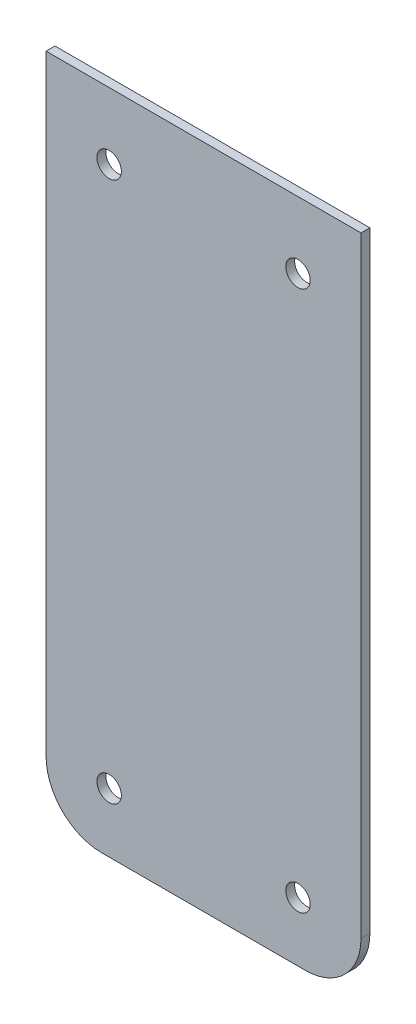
ISO-10303-21;
HEADER;
FILE_DESCRIPTION(('STEP AP214'),'2;1');
FILE_NAME('part.step','',(''),(''),'','','');
FILE_SCHEMA(('AUTOMOTIVE_DESIGN { 1 0 10303 214 1 1 1 1 }'));
ENDSEC;
DATA;
#1=APPLICATION_CONTEXT('core data for automotive mechanical design processes');
#2=APPLICATION_PROTOCOL_DEFINITION('international standard','automotive_design',2000,#1);
#3=PRODUCT_CONTEXT('',#1,'mechanical');
#4=PRODUCT('Part','Part','',(#3));
#5=PRODUCT_RELATED_PRODUCT_CATEGORY('part','',(#4));
#6=PRODUCT_DEFINITION_FORMATION('','',#4);
#7=PRODUCT_DEFINITION_CONTEXT('part definition',#1,'design');
#8=PRODUCT_DEFINITION('design','',#6,#7);
#9=PRODUCT_DEFINITION_SHAPE('','',#8);
#10=(LENGTH_UNIT() NAMED_UNIT(*) SI_UNIT(.MILLI.,.METRE.));
#11=(NAMED_UNIT(*) PLANE_ANGLE_UNIT() SI_UNIT($,.RADIAN.));
#12=(NAMED_UNIT(*) SI_UNIT($,.STERADIAN.) SOLID_ANGLE_UNIT());
#13=UNCERTAINTY_MEASURE_WITH_UNIT(LENGTH_MEASURE(1.E-05),#10,'distance_accuracy_value','');
#14=(GEOMETRIC_REPRESENTATION_CONTEXT(3) GLOBAL_UNCERTAINTY_ASSIGNED_CONTEXT((#13)) GLOBAL_UNIT_ASSIGNED_CONTEXT((#10,
#11,#12)) REPRESENTATION_CONTEXT('',''));
#15=CARTESIAN_POINT('',(0.,0.,0.));
#16=DIRECTION('',(0.,0.,1.));
#17=DIRECTION('',(1.,0.,0.));
#18=AXIS2_PLACEMENT_3D('',#15,#16,#17);
#19=CARTESIAN_POINT('',(28.35,60.,1.6));
#20=DIRECTION('',(-1.,0.,0.));
#21=DIRECTION('',(0.,-1.,0.));
#22=AXIS2_PLACEMENT_3D('',#19,#20,#21);
#23=PLANE('',#22);
#24=DIRECTION('',(0.,1.,0.));
#25=VECTOR('',#24,1.);
#26=CARTESIAN_POINT('',(28.35,60.,0.));
#27=LINE('',#26,#25);
#28=CARTESIAN_POINT('',(28.35,-50.,0.));
#29=VERTEX_POINT('',#28);
#30=CARTESIAN_POINT('',(28.35,60.,0.));
#31=VERTEX_POINT('',#30);
#32=EDGE_CURVE('E118',#29,#31,#27,.T.);
#33=ORIENTED_EDGE('',*,*,#32,.T.);
#34=DIRECTION('',(0.,0.,-1.));
#35=VECTOR('',#34,1.);
#36=CARTESIAN_POINT('',(28.35,60.,1.6));
#37=LINE('',#36,#35);
#38=CARTESIAN_POINT('',(28.35,60.,1.6));
#39=VERTEX_POINT('',#38);
#40=EDGE_CURVE('E11',#39,#31,#37,.T.);
#41=ORIENTED_EDGE('',*,*,#40,.F.);
#42=DIRECTION('',(0.,1.,0.));
#43=VECTOR('',#42,1.);
#44=CARTESIAN_POINT('',(28.35,60.,1.6));
#45=LINE('',#44,#43);
#46=CARTESIAN_POINT('',(28.35,-50.,1.6));
#47=VERTEX_POINT('',#46);
#48=EDGE_CURVE('E129',#47,#39,#45,.T.);
#49=ORIENTED_EDGE('',*,*,#48,.F.);
#50=DIRECTION('',(0.,0.,-1.));
#51=VECTOR('',#50,1.);
#52=CARTESIAN_POINT('',(28.35,-50.,1.6));
#53=LINE('',#52,#51);
#54=EDGE_CURVE('E114',#47,#29,#53,.T.);
#55=ORIENTED_EDGE('',*,*,#54,.T.);
#56=EDGE_LOOP('',(#33,#41,#49,#55));
#57=FACE_BOUND('',#56,.T.);
#58=ADVANCED_FACE('F34',(#57),#23,.F.);
#59=CARTESIAN_POINT('',(28.35,60.,1.6));
#60=DIRECTION('',(0.,-1.,0.));
#61=DIRECTION('',(1.,0.,0.));
#62=AXIS2_PLACEMENT_3D('',#59,#60,#61);
#63=PLANE('',#62);
#64=DIRECTION('',(-1.,0.,0.));
#65=VECTOR('',#64,1.);
#66=CARTESIAN_POINT('',(28.35,60.,0.));
#67=LINE('',#66,#65);
#68=CARTESIAN_POINT('',(-28.35,60.,0.));
#69=VERTEX_POINT('',#68);
#70=EDGE_CURVE('E121',#31,#69,#67,.T.);
#71=ORIENTED_EDGE('',*,*,#70,.T.);
#72=DIRECTION('',(0.,0.,-1.));
#73=VECTOR('',#72,1.);
#74=CARTESIAN_POINT('',(-28.35,60.,1.6));
#75=LINE('',#74,#73);
#76=CARTESIAN_POINT('',(-28.35,60.,1.6));
#77=VERTEX_POINT('',#76);
#78=EDGE_CURVE('E42',#77,#69,#75,.T.);
#79=ORIENTED_EDGE('',*,*,#78,.F.);
#80=DIRECTION('',(-1.,0.,0.));
#81=VECTOR('',#80,1.);
#82=CARTESIAN_POINT('',(28.35,60.,1.6));
#83=LINE('',#82,#81);
#84=EDGE_CURVE('E87',#39,#77,#83,.T.);
#85=ORIENTED_EDGE('',*,*,#84,.F.);
#86=ORIENTED_EDGE('',*,*,#40,.T.);
#87=EDGE_LOOP('',(#71,#79,#85,#86));
#88=FACE_BOUND('',#87,.T.);
#89=ADVANCED_FACE('F154',(#88),#63,.F.);
#90=CARTESIAN_POINT('',(-28.35,60.,1.6));
#91=DIRECTION('',(1.,0.,0.));
#92=DIRECTION('',(0.,1.,0.));
#93=AXIS2_PLACEMENT_3D('',#90,#91,#92);
#94=PLANE('',#93);
#95=DIRECTION('',(0.,-1.,0.));
#96=VECTOR('',#95,1.);
#97=CARTESIAN_POINT('',(-28.35,60.,0.));
#98=LINE('',#97,#96);
#99=CARTESIAN_POINT('',(-28.35,-50.,0.));
#100=VERTEX_POINT('',#99);
#101=EDGE_CURVE('E124',#69,#100,#98,.T.);
#102=ORIENTED_EDGE('',*,*,#101,.T.);
#103=DIRECTION('',(0.,0.,-1.));
#104=VECTOR('',#103,1.);
#105=CARTESIAN_POINT('',(-28.35,-50.,1.6));
#106=LINE('',#105,#104);
#107=CARTESIAN_POINT('',(-28.35,-50.,1.6));
#108=VERTEX_POINT('',#107);
#109=EDGE_CURVE('E109',#108,#100,#106,.T.);
#110=ORIENTED_EDGE('',*,*,#109,.F.);
#111=DIRECTION('',(0.,-1.,0.));
#112=VECTOR('',#111,1.);
#113=CARTESIAN_POINT('',(-28.35,60.,1.6));
#114=LINE('',#113,#112);
#115=EDGE_CURVE('E100',#77,#108,#114,.T.);
#116=ORIENTED_EDGE('',*,*,#115,.F.);
#117=ORIENTED_EDGE('',*,*,#78,.T.);
#118=EDGE_LOOP('',(#102,#110,#116,#117));
#119=FACE_BOUND('',#118,.T.);
#120=ADVANCED_FACE('F135',(#119),#94,.F.);
#121=CARTESIAN_POINT('',(-18.35,-50.,1.6));
#122=DIRECTION('',(0.,0.,-1.));
#123=DIRECTION('',(-1.,0.,0.));
#124=AXIS2_PLACEMENT_3D('',#121,#122,#123);
#125=CYLINDRICAL_SURFACE('',#124,10.);
#126=CARTESIAN_POINT('',(-18.35,-50.,0.));
#127=DIRECTION('',(0.,0.,1.));
#128=DIRECTION('',(1.,0.,0.));
#129=AXIS2_PLACEMENT_3D('',#126,#127,#128);
#130=CIRCLE('',#129,10.);
#131=CARTESIAN_POINT('',(-18.35,-60.,0.));
#132=VERTEX_POINT('',#131);
#133=EDGE_CURVE('E108',#100,#132,#130,.T.);
#134=ORIENTED_EDGE('',*,*,#133,.T.);
#135=DIRECTION('',(0.,0.,-1.));
#136=VECTOR('',#135,1.);
#137=CARTESIAN_POINT('',(-18.35,-60.,1.6));
#138=LINE('',#137,#136);
#139=CARTESIAN_POINT('',(-18.35,-60.,1.6));
#140=VERTEX_POINT('',#139);
#141=EDGE_CURVE('E105',#140,#132,#138,.T.);
#142=ORIENTED_EDGE('',*,*,#141,.F.);
#143=CARTESIAN_POINT('',(-18.35,-50.,1.6));
#144=DIRECTION('',(0.,0.,1.));
#145=DIRECTION('',(1.,0.,0.));
#146=AXIS2_PLACEMENT_3D('',#143,#144,#145);
#147=CIRCLE('',#146,10.);
#148=EDGE_CURVE('E94',#108,#140,#147,.T.);
#149=ORIENTED_EDGE('',*,*,#148,.F.);
#150=ORIENTED_EDGE('',*,*,#109,.T.);
#151=EDGE_LOOP('',(#134,#142,#149,#150));
#152=FACE_BOUND('',#151,.T.);
#153=ADVANCED_FACE('F106',(#152),#125,.T.);
#154=CARTESIAN_POINT('',(18.35,-60.,1.6));
#155=DIRECTION('',(0.,1.,0.));
#156=DIRECTION('',(-1.,0.,0.));
#157=AXIS2_PLACEMENT_3D('',#154,#155,#156);
#158=PLANE('',#157);
#159=DIRECTION('',(1.,0.,0.));
#160=VECTOR('',#159,1.);
#161=CARTESIAN_POINT('',(18.35,-60.,0.));
#162=LINE('',#161,#160);
#163=CARTESIAN_POINT('',(18.35,-60.,0.));
#164=VERTEX_POINT('',#163);
#165=EDGE_CURVE('E73',#132,#164,#162,.T.);
#166=ORIENTED_EDGE('',*,*,#165,.T.);
#167=DIRECTION('',(0.,0.,-1.));
#168=VECTOR('',#167,1.);
#169=CARTESIAN_POINT('',(18.35,-60.,1.6));
#170=LINE('',#169,#168);
#171=CARTESIAN_POINT('',(18.35,-60.,1.6));
#172=VERTEX_POINT('',#171);
#173=EDGE_CURVE('E110',#172,#164,#170,.T.);
#174=ORIENTED_EDGE('',*,*,#173,.F.);
#175=DIRECTION('',(1.,0.,0.));
#176=VECTOR('',#175,1.);
#177=CARTESIAN_POINT('',(18.35,-60.,1.6));
#178=LINE('',#177,#176);
#179=EDGE_CURVE('E98',#140,#172,#178,.T.);
#180=ORIENTED_EDGE('',*,*,#179,.F.);
#181=ORIENTED_EDGE('',*,*,#141,.T.);
#182=EDGE_LOOP('',(#166,#174,#180,#181));
#183=FACE_BOUND('',#182,.T.);
#184=ADVANCED_FACE('F112',(#183),#158,.F.);
#185=CARTESIAN_POINT('',(18.35,-50.,1.6));
#186=DIRECTION('',(0.,0.,-1.));
#187=DIRECTION('',(-1.,0.,0.));
#188=AXIS2_PLACEMENT_3D('',#185,#186,#187);
#189=CYLINDRICAL_SURFACE('',#188,10.);
#190=CARTESIAN_POINT('',(18.35,-50.,0.));
#191=DIRECTION('',(0.,0.,1.));
#192=DIRECTION('',(1.,0.,0.));
#193=AXIS2_PLACEMENT_3D('',#190,#191,#192);
#194=CIRCLE('',#193,10.);
#195=EDGE_CURVE('E79',#164,#29,#194,.T.);
#196=ORIENTED_EDGE('',*,*,#195,.T.);
#197=ORIENTED_EDGE('',*,*,#54,.F.);
#198=CARTESIAN_POINT('',(18.35,-50.,1.6));
#199=DIRECTION('',(0.,0.,1.));
#200=DIRECTION('',(1.,0.,0.));
#201=AXIS2_PLACEMENT_3D('',#198,#199,#200);
#202=CIRCLE('',#201,10.);
#203=EDGE_CURVE('E50',#172,#47,#202,.T.);
#204=ORIENTED_EDGE('',*,*,#203,.F.);
#205=ORIENTED_EDGE('',*,*,#173,.T.);
#206=EDGE_LOOP('',(#196,#197,#204,#205));
#207=FACE_BOUND('',#206,.T.);
#208=ADVANCED_FACE('F142',(#207),#189,.T.);
#209=CARTESIAN_POINT('',(18.35,-50.,1.6));
#210=DIRECTION('',(0.,0.,1.));
#211=DIRECTION('',(1.,0.,0.));
#212=AXIS2_PLACEMENT_3D('',#209,#210,#211);
#213=PLANE('',#212);
#214=CARTESIAN_POINT('',(17.,-49.3,1.6));
#215=DIRECTION('',(0.,0.,1.));
#216=DIRECTION('',(1.,0.,0.));
#217=AXIS2_PLACEMENT_3D('',#214,#215,#216);
#218=CIRCLE('',#217,2.2);
#219=CARTESIAN_POINT('',(19.2,-49.3,1.6));
#220=VERTEX_POINT('',#219);
#221=EDGE_CURVE('E240',#220,#220,#218,.T.);
#222=ORIENTED_EDGE('',*,*,#221,.F.);
#223=EDGE_LOOP('',(#222));
#224=FACE_BOUND('',#223,.T.);
#225=CARTESIAN_POINT('',(-17.,-49.3,1.6));
#226=DIRECTION('',(0.,0.,1.));
#227=DIRECTION('',(1.,0.,0.));
#228=AXIS2_PLACEMENT_3D('',#225,#226,#227);
#229=CIRCLE('',#228,2.2);
#230=CARTESIAN_POINT('',(-14.8,-49.3,1.6));
#231=VERTEX_POINT('',#230);
#232=EDGE_CURVE('E242',#231,#231,#229,.T.);
#233=ORIENTED_EDGE('',*,*,#232,.F.);
#234=EDGE_LOOP('',(#233));
#235=FACE_BOUND('',#234,.T.);
#236=CARTESIAN_POINT('',(17.,48.,1.6));
#237=DIRECTION('',(0.,0.,1.));
#238=DIRECTION('',(1.,0.,0.));
#239=AXIS2_PLACEMENT_3D('',#236,#237,#238);
#240=CIRCLE('',#239,2.2);
#241=CARTESIAN_POINT('',(19.2,48.,1.6));
#242=VERTEX_POINT('',#241);
#243=EDGE_CURVE('E248',#242,#242,#240,.T.);
#244=ORIENTED_EDGE('',*,*,#243,.F.);
#245=EDGE_LOOP('',(#244));
#246=FACE_BOUND('',#245,.T.);
#247=CARTESIAN_POINT('',(-17.,48.,1.6));
#248=DIRECTION('',(0.,0.,1.));
#249=DIRECTION('',(1.,0.,0.));
#250=AXIS2_PLACEMENT_3D('',#247,#248,#249);
#251=CIRCLE('',#250,2.2);
#252=CARTESIAN_POINT('',(-14.8,48.,1.6));
#253=VERTEX_POINT('',#252);
#254=EDGE_CURVE('E254',#253,#253,#251,.T.);
#255=ORIENTED_EDGE('',*,*,#254,.F.);
#256=EDGE_LOOP('',(#255));
#257=FACE_BOUND('',#256,.T.);
#258=ORIENTED_EDGE('',*,*,#48,.T.);
#259=ORIENTED_EDGE('',*,*,#84,.T.);
#260=ORIENTED_EDGE('',*,*,#115,.T.);
#261=ORIENTED_EDGE('',*,*,#148,.T.);
#262=ORIENTED_EDGE('',*,*,#179,.T.);
#263=ORIENTED_EDGE('',*,*,#203,.T.);
#264=EDGE_LOOP('',(#258,#259,#260,#261,#262,#263));
#265=FACE_BOUND('',#264,.T.);
#266=ADVANCED_FACE('F96',(#224,#235,#246,#257,#265),#213,.T.);
#267=CARTESIAN_POINT('',(18.35,-50.,0.));
#268=DIRECTION('',(0.,0.,1.));
#269=DIRECTION('',(1.,0.,0.));
#270=AXIS2_PLACEMENT_3D('',#267,#268,#269);
#271=PLANE('',#270);
#272=CARTESIAN_POINT('',(17.,-49.3,0.));
#273=DIRECTION('',(0.,0.,1.));
#274=DIRECTION('',(1.,0.,0.));
#275=AXIS2_PLACEMENT_3D('',#272,#273,#274);
#276=CIRCLE('',#275,2.2);
#277=CARTESIAN_POINT('',(19.2,-49.3,0.));
#278=VERTEX_POINT('',#277);
#279=EDGE_CURVE('E237',#278,#278,#276,.T.);
#280=ORIENTED_EDGE('',*,*,#279,.T.);
#281=EDGE_LOOP('',(#280));
#282=FACE_BOUND('',#281,.T.);
#283=CARTESIAN_POINT('',(-17.,-49.3,0.));
#284=DIRECTION('',(0.,0.,1.));
#285=DIRECTION('',(1.,0.,0.));
#286=AXIS2_PLACEMENT_3D('',#283,#284,#285);
#287=CIRCLE('',#286,2.2);
#288=CARTESIAN_POINT('',(-14.8,-49.3,0.));
#289=VERTEX_POINT('',#288);
#290=EDGE_CURVE('E245',#289,#289,#287,.T.);
#291=ORIENTED_EDGE('',*,*,#290,.T.);
#292=EDGE_LOOP('',(#291));
#293=FACE_BOUND('',#292,.T.);
#294=CARTESIAN_POINT('',(17.,48.,0.));
#295=DIRECTION('',(0.,0.,1.));
#296=DIRECTION('',(1.,0.,0.));
#297=AXIS2_PLACEMENT_3D('',#294,#295,#296);
#298=CIRCLE('',#297,2.2);
#299=CARTESIAN_POINT('',(19.2,48.,0.));
#300=VERTEX_POINT('',#299);
#301=EDGE_CURVE('E251',#300,#300,#298,.T.);
#302=ORIENTED_EDGE('',*,*,#301,.T.);
#303=EDGE_LOOP('',(#302));
#304=FACE_BOUND('',#303,.T.);
#305=CARTESIAN_POINT('',(-17.,48.,0.));
#306=DIRECTION('',(0.,0.,1.));
#307=DIRECTION('',(1.,0.,0.));
#308=AXIS2_PLACEMENT_3D('',#305,#306,#307);
#309=CIRCLE('',#308,2.2);
#310=CARTESIAN_POINT('',(-14.8,48.,0.));
#311=VERTEX_POINT('',#310);
#312=EDGE_CURVE('E122',#311,#311,#309,.T.);
#313=ORIENTED_EDGE('',*,*,#312,.T.);
#314=EDGE_LOOP('',(#313));
#315=FACE_BOUND('',#314,.T.);
#316=ORIENTED_EDGE('',*,*,#32,.F.);
#317=ORIENTED_EDGE('',*,*,#195,.F.);
#318=ORIENTED_EDGE('',*,*,#165,.F.);
#319=ORIENTED_EDGE('',*,*,#133,.F.);
#320=ORIENTED_EDGE('',*,*,#101,.F.);
#321=ORIENTED_EDGE('',*,*,#70,.F.);
#322=EDGE_LOOP('',(#316,#317,#318,#319,#320,#321));
#323=FACE_BOUND('',#322,.T.);
#324=ADVANCED_FACE('F138',(#282,#293,#304,#315,#323),#271,.F.);
#325=CARTESIAN_POINT('',(-17.,48.,0.));
#326=DIRECTION('',(0.,0.,1.));
#327=DIRECTION('',(1.,0.,0.));
#328=AXIS2_PLACEMENT_3D('',#325,#326,#327);
#329=CYLINDRICAL_SURFACE('',#328,2.2);
#330=ORIENTED_EDGE('',*,*,#312,.F.);
#331=EDGE_LOOP('',(#330));
#332=FACE_BOUND('',#331,.T.);
#333=ORIENTED_EDGE('',*,*,#254,.T.);
#334=EDGE_LOOP('',(#333));
#335=FACE_BOUND('',#334,.T.);
#336=ADVANCED_FACE('F191',(#332,#335),#329,.F.);
#337=CARTESIAN_POINT('',(17.,48.,0.));
#338=DIRECTION('',(0.,0.,1.));
#339=DIRECTION('',(1.,0.,0.));
#340=AXIS2_PLACEMENT_3D('',#337,#338,#339);
#341=CYLINDRICAL_SURFACE('',#340,2.2);
#342=ORIENTED_EDGE('',*,*,#301,.F.);
#343=EDGE_LOOP('',(#342));
#344=FACE_BOUND('',#343,.T.);
#345=ORIENTED_EDGE('',*,*,#243,.T.);
#346=EDGE_LOOP('',(#345));
#347=FACE_BOUND('',#346,.T.);
#348=ADVANCED_FACE('F200',(#344,#347),#341,.F.);
#349=CARTESIAN_POINT('',(-17.,-49.3,0.));
#350=DIRECTION('',(0.,0.,1.));
#351=DIRECTION('',(1.,0.,0.));
#352=AXIS2_PLACEMENT_3D('',#349,#350,#351);
#353=CYLINDRICAL_SURFACE('',#352,2.2);
#354=ORIENTED_EDGE('',*,*,#290,.F.);
#355=EDGE_LOOP('',(#354));
#356=FACE_BOUND('',#355,.T.);
#357=ORIENTED_EDGE('',*,*,#232,.T.);
#358=EDGE_LOOP('',(#357));
#359=FACE_BOUND('',#358,.T.);
#360=ADVANCED_FACE('F210',(#356,#359),#353,.F.);
#361=CARTESIAN_POINT('',(17.,-49.3,0.));
#362=DIRECTION('',(0.,0.,1.));
#363=DIRECTION('',(1.,0.,0.));
#364=AXIS2_PLACEMENT_3D('',#361,#362,#363);
#365=CYLINDRICAL_SURFACE('',#364,2.2);
#366=ORIENTED_EDGE('',*,*,#279,.F.);
#367=EDGE_LOOP('',(#366));
#368=FACE_BOUND('',#367,.T.);
#369=ORIENTED_EDGE('',*,*,#221,.T.);
#370=EDGE_LOOP('',(#369));
#371=FACE_BOUND('',#370,.T.);
#372=ADVANCED_FACE('F220',(#368,#371),#365,.F.);
#373=CLOSED_SHELL('',(#58,#89,#120,#153,#184,#208,#266,#324,#336,#348,#360,#372));
#374=MANIFOLD_SOLID_BREP('B2',#373);
#375=ADVANCED_BREP_SHAPE_REPRESENTATION('',(#18,#374),#14);
#376=SHAPE_DEFINITION_REPRESENTATION(#9,#375);
ENDSEC;
END-ISO-10303-21;
